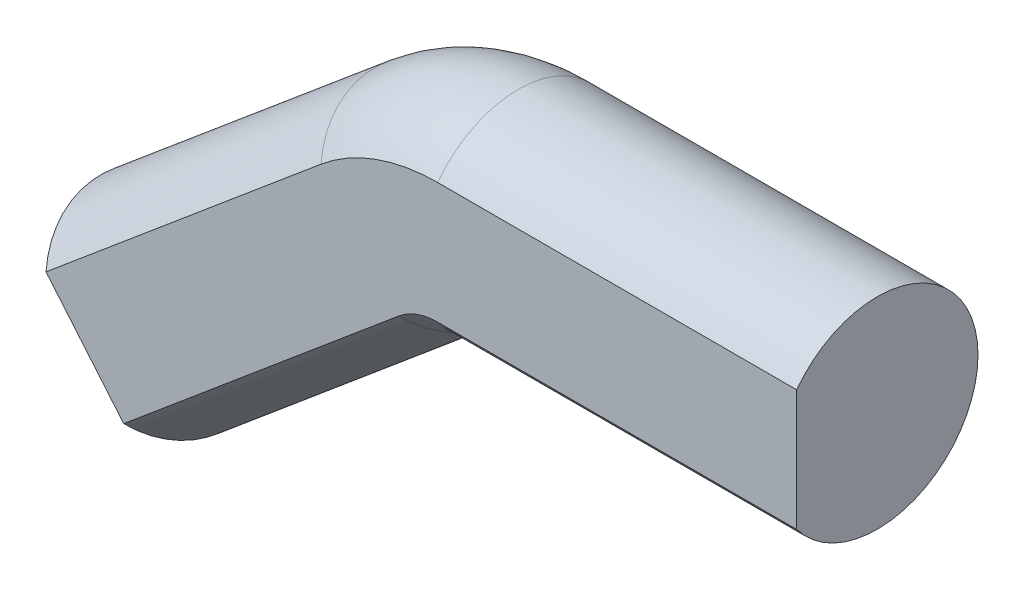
ISO-10303-21;
HEADER;
FILE_DESCRIPTION(('STEP AP214'),'2;1');
FILE_NAME('part.step','',(''),(''),'','','');
FILE_SCHEMA(('AUTOMOTIVE_DESIGN { 1 0 10303 214 1 1 1 1 }'));
ENDSEC;
DATA;
#1=APPLICATION_CONTEXT('core data for automotive mechanical design processes');
#2=APPLICATION_PROTOCOL_DEFINITION('international standard','automotive_design',2000,#1);
#3=PRODUCT_CONTEXT('',#1,'mechanical');
#4=PRODUCT('Part','Part','',(#3));
#5=PRODUCT_RELATED_PRODUCT_CATEGORY('part','',(#4));
#6=PRODUCT_DEFINITION_FORMATION('','',#4);
#7=PRODUCT_DEFINITION_CONTEXT('part definition',#1,'design');
#8=PRODUCT_DEFINITION('design','',#6,#7);
#9=PRODUCT_DEFINITION_SHAPE('','',#8);
#10=(LENGTH_UNIT() NAMED_UNIT(*) SI_UNIT(.MILLI.,.METRE.));
#11=(NAMED_UNIT(*) PLANE_ANGLE_UNIT() SI_UNIT($,.RADIAN.));
#12=(NAMED_UNIT(*) SI_UNIT($,.STERADIAN.) SOLID_ANGLE_UNIT());
#13=UNCERTAINTY_MEASURE_WITH_UNIT(LENGTH_MEASURE(1.E-05),#10,'distance_accuracy_value','');
#14=(GEOMETRIC_REPRESENTATION_CONTEXT(3) GLOBAL_UNCERTAINTY_ASSIGNED_CONTEXT((#13)) GLOBAL_UNIT_ASSIGNED_CONTEXT((#10,
#11,#12)) REPRESENTATION_CONTEXT('',''));
#15=CARTESIAN_POINT('',(0.,0.,0.));
#16=DIRECTION('',(0.,0.,1.));
#17=DIRECTION('',(1.,0.,0.));
#18=AXIS2_PLACEMENT_3D('',#15,#16,#17);
#19=CARTESIAN_POINT('',(0.,0.,10.));
#20=DIRECTION('',(0.,0.,1.));
#21=DIRECTION('',(1.,0.,0.));
#22=AXIS2_PLACEMENT_3D('',#19,#20,#21);
#23=PLANE('',#22);
#24=DIRECTION('',(-0.642787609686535,0.766044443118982,0.));
#25=VECTOR('',#24,1.);
#26=CARTESIAN_POINT('',(-38.3022221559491,-32.1393804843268,10.));
#27=LINE('',#26,#25);
#28=CARTESIAN_POINT('',(-33.4813150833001,-37.8847138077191,10.));
#29=VERTEX_POINT('',#28);
#30=CARTESIAN_POINT('',(-43.1231292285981,-26.3940471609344,10.));
#31=VERTEX_POINT('',#30);
#32=EDGE_CURVE('E78',#29,#31,#27,.T.);
#33=ORIENTED_EDGE('',*,*,#32,.F.);
#34=DIRECTION('',(0.766044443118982,0.642787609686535,0.));
#35=VECTOR('',#34,1.);
#36=CARTESIAN_POINT('',(-33.4813150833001,-37.8847138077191,10.));
#37=LINE('',#36,#35);
#38=CARTESIAN_POINT('',(0.638646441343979,-9.25466667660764,10.));
#39=VERTEX_POINT('',#38);
#40=EDGE_CURVE('E72',#29,#39,#37,.T.);
#41=ORIENTED_EDGE('',*,*,#40,.T.);
#42=CARTESIAN_POINT('',(5.45955351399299,-15.,10.));
#43=DIRECTION('',(0.,0.,-1.));
#44=DIRECTION('',(-1.,0.,0.));
#45=AXIS2_PLACEMENT_3D('',#42,#43,#44);
#46=CIRCLE('',#45,7.5);
#47=CARTESIAN_POINT('',(5.45955351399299,-7.5,10.));
#48=VERTEX_POINT('',#47);
#49=EDGE_CURVE('E133',#39,#48,#46,.T.);
#50=ORIENTED_EDGE('',*,*,#49,.T.);
#51=DIRECTION('',(1.,0.,0.));
#52=VECTOR('',#51,1.);
#53=CARTESIAN_POINT('',(5.45955351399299,-7.5,10.));
#54=LINE('',#53,#52);
#55=CARTESIAN_POINT('',(50.,-7.5,10.));
#56=VERTEX_POINT('',#55);
#57=EDGE_CURVE('E13',#48,#56,#54,.T.);
#58=ORIENTED_EDGE('',*,*,#57,.T.);
#59=DIRECTION('',(0.,1.,0.));
#60=VECTOR('',#59,1.);
#61=CARTESIAN_POINT('',(50.,0.,10.));
#62=LINE('',#61,#60);
#63=CARTESIAN_POINT('',(50.,7.5,10.));
#64=VERTEX_POINT('',#63);
#65=EDGE_CURVE('E120',#56,#64,#62,.T.);
#66=ORIENTED_EDGE('',*,*,#65,.T.);
#67=DIRECTION('',(1.,0.,0.));
#68=VECTOR('',#67,1.);
#69=CARTESIAN_POINT('',(5.45955351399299,7.5,10.));
#70=LINE('',#69,#68);
#71=CARTESIAN_POINT('',(5.45955351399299,7.5,10.));
#72=VERTEX_POINT('',#71);
#73=EDGE_CURVE('E65',#64,#72,#70,.F.);
#74=ORIENTED_EDGE('',*,*,#73,.T.);
#75=CARTESIAN_POINT('',(5.45955351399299,-15.,10.));
#76=DIRECTION('',(0.,0.,1.));
#77=DIRECTION('',(1.,0.,0.));
#78=AXIS2_PLACEMENT_3D('',#75,#76,#77);
#79=CIRCLE('',#78,22.5);
#80=CARTESIAN_POINT('',(-9.00316770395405,2.23599997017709,10.));
#81=VERTEX_POINT('',#80);
#82=EDGE_CURVE('E112',#72,#81,#79,.T.);
#83=ORIENTED_EDGE('',*,*,#82,.T.);
#84=DIRECTION('',(0.766044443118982,0.642787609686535,0.));
#85=VECTOR('',#84,1.);
#86=CARTESIAN_POINT('',(-43.1231292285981,-26.3940471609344,10.));
#87=LINE('',#86,#85);
#88=EDGE_CURVE('E117',#81,#31,#87,.F.);
#89=ORIENTED_EDGE('',*,*,#88,.T.);
#90=EDGE_LOOP('',(#33,#41,#50,#58,#66,#74,#83,#89));
#91=FACE_BOUND('',#90,.T.);
#92=ADVANCED_FACE('F56',(#91),#23,.T.);
#93=CARTESIAN_POINT('',(-38.3022221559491,-32.1393804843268,0.));
#94=DIRECTION('',(-0.766044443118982,-0.642787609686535,0.));
#95=DIRECTION('',(0.,0.,1.));
#96=AXIS2_PLACEMENT_3D('',#93,#94,#95);
#97=PLANE('',#96);
#98=CARTESIAN_POINT('',(-38.3022221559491,-32.1393804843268,0.));
#99=DIRECTION('',(-0.766044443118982,-0.642787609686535,0.));
#100=DIRECTION('',(0.,0.,1.));
#101=AXIS2_PLACEMENT_3D('',#98,#99,#100);
#102=CIRCLE('',#101,12.5);
#103=EDGE_CURVE('E128',#31,#29,#102,.T.);
#104=ORIENTED_EDGE('',*,*,#103,.T.);
#105=ORIENTED_EDGE('',*,*,#32,.T.);
#106=EDGE_LOOP('',(#104,#105));
#107=FACE_BOUND('',#106,.T.);
#108=ADVANCED_FACE('F58',(#107),#97,.T.);
#109=CARTESIAN_POINT('',(50.,0.,0.));
#110=DIRECTION('',(-1.,0.,0.));
#111=DIRECTION('',(0.,0.,1.));
#112=AXIS2_PLACEMENT_3D('',#109,#110,#111);
#113=PLANE('',#112);
#114=ORIENTED_EDGE('',*,*,#65,.F.);
#115=CARTESIAN_POINT('',(50.,0.,0.));
#116=DIRECTION('',(-1.,0.,0.));
#117=DIRECTION('',(0.,0.,1.));
#118=AXIS2_PLACEMENT_3D('',#115,#116,#117);
#119=CIRCLE('',#118,12.5);
#120=EDGE_CURVE('E107',#64,#56,#119,.T.);
#121=ORIENTED_EDGE('',*,*,#120,.F.);
#122=EDGE_LOOP('',(#114,#121));
#123=FACE_BOUND('',#122,.T.);
#124=ADVANCED_FACE('F144',(#123),#113,.F.);
#125=CARTESIAN_POINT('',(-38.3022221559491,-32.1393804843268,0.));
#126=DIRECTION('',(0.766044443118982,0.642787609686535,0.));
#127=DIRECTION('',(-0.642787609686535,0.766044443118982,0.));
#128=AXIS2_PLACEMENT_3D('',#125,#126,#127);
#129=CYLINDRICAL_SURFACE('',#128,12.5);
#130=ORIENTED_EDGE('',*,*,#40,.F.);
#131=ORIENTED_EDGE('',*,*,#103,.F.);
#132=ORIENTED_EDGE('',*,*,#88,.F.);
#133=CARTESIAN_POINT('',(-4.18226063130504,-3.50933335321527,0.));
#134=DIRECTION('',(-0.766044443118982,-0.642787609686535,0.));
#135=DIRECTION('',(0.,0.,1.));
#136=AXIS2_PLACEMENT_3D('',#133,#134,#135);
#137=CIRCLE('',#136,12.5);
#138=EDGE_CURVE('E108',#81,#39,#137,.T.);
#139=ORIENTED_EDGE('',*,*,#138,.T.);
#140=EDGE_LOOP('',(#130,#131,#132,#139));
#141=FACE_BOUND('',#140,.T.);
#142=ADVANCED_FACE('F142',(#141),#129,.T.);
#143=CARTESIAN_POINT('',(5.45955351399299,-15.,0.));
#144=DIRECTION('',(0.,0.,-1.));
#145=DIRECTION('',(-1.,0.,0.));
#146=AXIS2_PLACEMENT_3D('',#143,#144,#145);
#147=TOROIDAL_SURFACE('',#146,15.,12.5);
#148=ORIENTED_EDGE('',*,*,#82,.F.);
#149=CARTESIAN_POINT('',(5.45955351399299,0.,0.));
#150=DIRECTION('',(-1.,0.,0.));
#151=DIRECTION('',(0.,0.,1.));
#152=AXIS2_PLACEMENT_3D('',#149,#150,#151);
#153=CIRCLE('',#152,12.5);
#154=EDGE_CURVE('E98',#72,#48,#153,.T.);
#155=ORIENTED_EDGE('',*,*,#154,.T.);
#156=ORIENTED_EDGE('',*,*,#49,.F.);
#157=ORIENTED_EDGE('',*,*,#138,.F.);
#158=EDGE_LOOP('',(#148,#155,#156,#157));
#159=FACE_BOUND('',#158,.T.);
#160=ADVANCED_FACE('F113',(#159),#147,.T.);
#161=CARTESIAN_POINT('',(5.45955351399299,0.,0.));
#162=DIRECTION('',(1.,0.,0.));
#163=DIRECTION('',(0.,0.,-1.));
#164=AXIS2_PLACEMENT_3D('',#161,#162,#163);
#165=CYLINDRICAL_SURFACE('',#164,12.5);
#166=ORIENTED_EDGE('',*,*,#57,.F.);
#167=ORIENTED_EDGE('',*,*,#154,.F.);
#168=ORIENTED_EDGE('',*,*,#73,.F.);
#169=ORIENTED_EDGE('',*,*,#120,.T.);
#170=EDGE_LOOP('',(#166,#167,#168,#169));
#171=FACE_BOUND('',#170,.T.);
#172=ADVANCED_FACE('F100',(#171),#165,.T.);
#173=CLOSED_SHELL('',(#92,#108,#124,#142,#160,#172));
#174=MANIFOLD_SOLID_BREP('B2',#173);
#175=ADVANCED_BREP_SHAPE_REPRESENTATION('',(#18,#174),#14);
#176=SHAPE_DEFINITION_REPRESENTATION(#9,#175);
ENDSEC;
END-ISO-10303-21;
